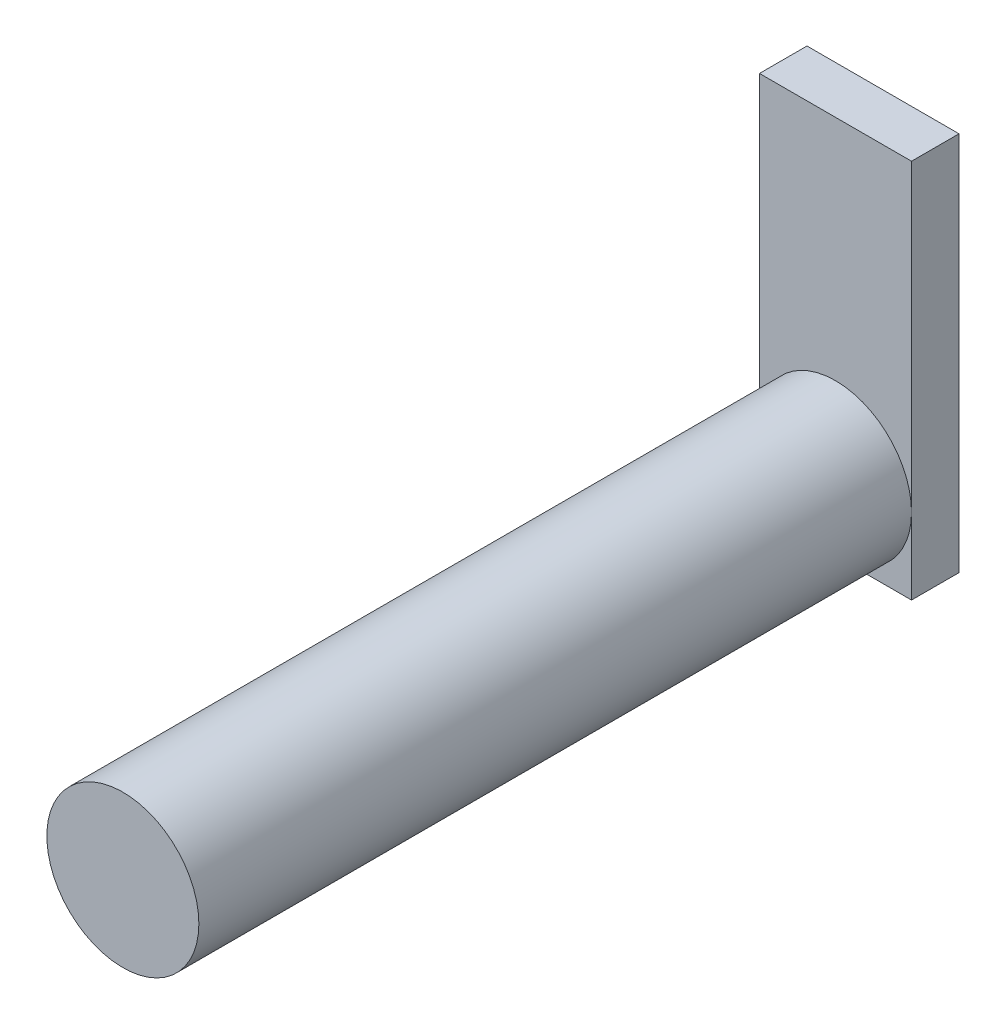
from build123d import *

# Parameters (mm, degrees)
ESQUISSE1_R        = 16
BOSS_EXTRU_1_DEPTH = 150
ESQUISSE2_W        = 32
ESQUISSE2_H        = 80
BOSS_EXTRU_2_DEPTH = 10


with BuildPart() as part:
    # Esquisse1 → Boss.-Extru.1 (new body)
    with BuildSketch(Plane.XY):
        Circle(ESQUISSE1_R)
    extrude(amount=BOSS_EXTRU_1_DEPTH)

    # Esquisse2 → Boss.-Extru.2 (add)
    with BuildSketch(Plane(origin=(0, 0, 0), x_dir=(-1, 0, 0), z_dir=(0, 0, -1))):
        with Locations((0, 24)):
            Rectangle(ESQUISSE2_W, ESQUISSE2_H)
    extrude(amount=BOSS_EXTRU_2_DEPTH)


solid = part.part
